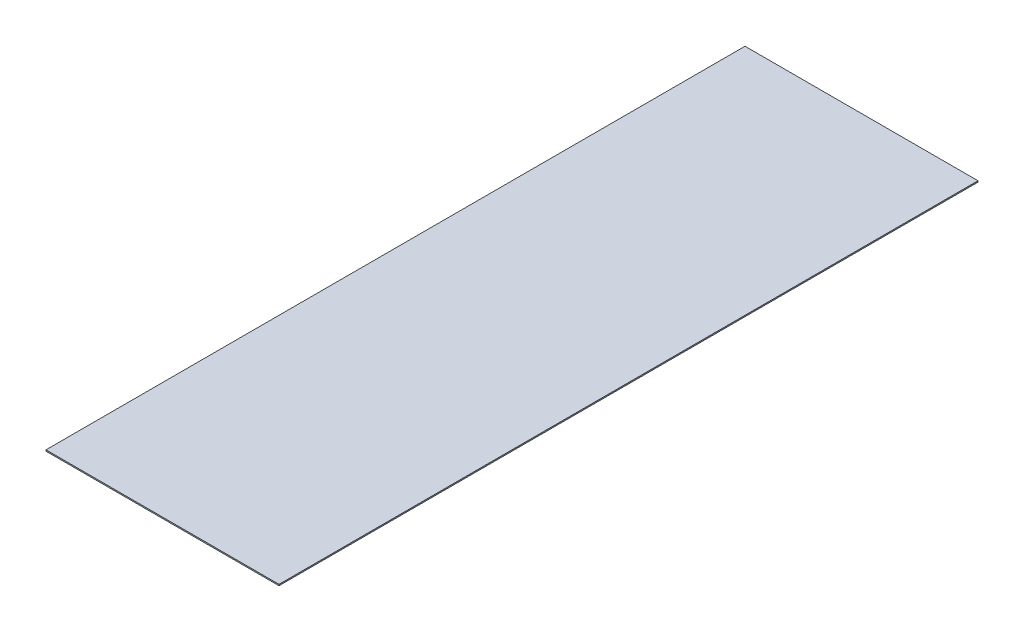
from build123d import *

# Parameters (mm, degrees)
SKETCH1_W           = 47.625
SKETCH1_H           = 142.875
BOSS_EXTRUDE1_DEPTH = 0.254


with BuildPart() as part:
    # Sketch1 → Boss-Extrude1 (new body)
    with BuildSketch(Plane(origin=(0, 0, 0), x_dir=(1, 0, 0), z_dir=(0, 1, 0))):
        with Locations((-23.8125, -71.4375)):
            Rectangle(SKETCH1_W, SKETCH1_H)
    extrude(amount=BOSS_EXTRUDE1_DEPTH)


solid = part.part
